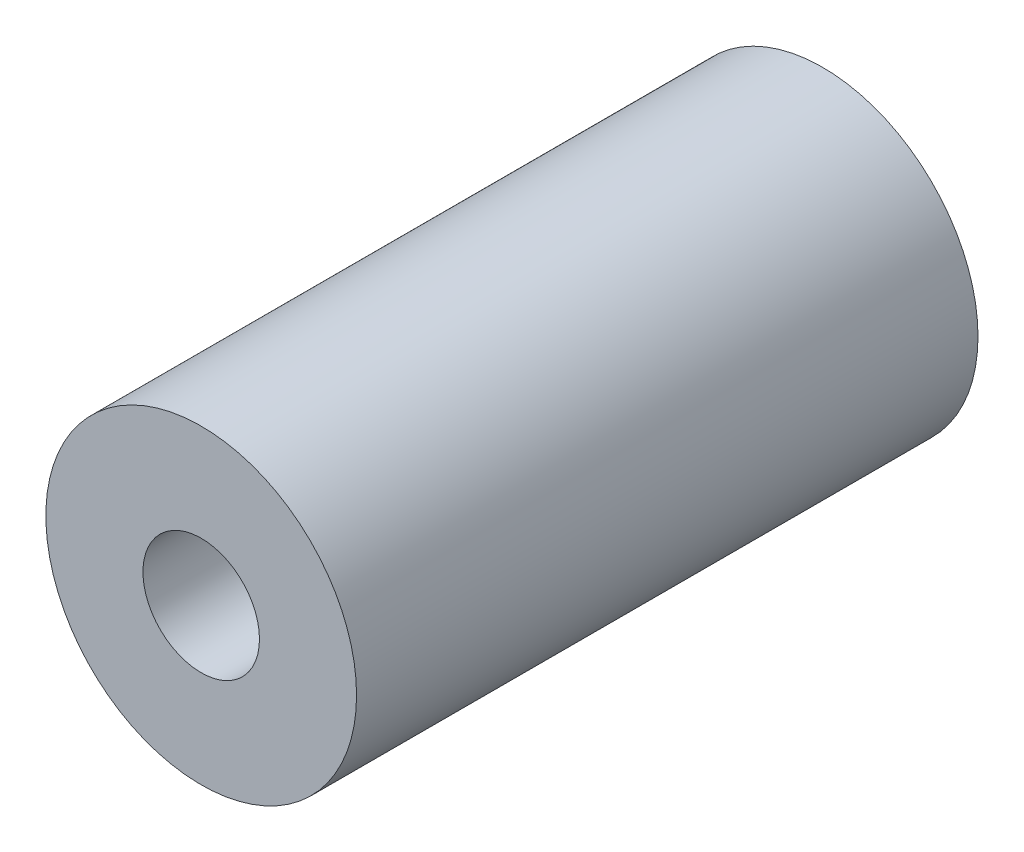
ISO-10303-21;
HEADER;
FILE_DESCRIPTION(('STEP AP214'),'2;1');
FILE_NAME('part.step','',(''),(''),'','','');
FILE_SCHEMA(('AUTOMOTIVE_DESIGN { 1 0 10303 214 1 1 1 1 }'));
ENDSEC;
DATA;
#1=APPLICATION_CONTEXT('core data for automotive mechanical design processes');
#2=APPLICATION_PROTOCOL_DEFINITION('international standard','automotive_design',2000,#1);
#3=PRODUCT_CONTEXT('',#1,'mechanical');
#4=PRODUCT('Part','Part','',(#3));
#5=PRODUCT_RELATED_PRODUCT_CATEGORY('part','',(#4));
#6=PRODUCT_DEFINITION_FORMATION('','',#4);
#7=PRODUCT_DEFINITION_CONTEXT('part definition',#1,'design');
#8=PRODUCT_DEFINITION('design','',#6,#7);
#9=PRODUCT_DEFINITION_SHAPE('','',#8);
#10=(LENGTH_UNIT() NAMED_UNIT(*) SI_UNIT(.MILLI.,.METRE.));
#11=(NAMED_UNIT(*) PLANE_ANGLE_UNIT() SI_UNIT($,.RADIAN.));
#12=(NAMED_UNIT(*) SI_UNIT($,.STERADIAN.) SOLID_ANGLE_UNIT());
#13=UNCERTAINTY_MEASURE_WITH_UNIT(LENGTH_MEASURE(1.E-05),#10,'distance_accuracy_value','');
#14=(GEOMETRIC_REPRESENTATION_CONTEXT(3) GLOBAL_UNCERTAINTY_ASSIGNED_CONTEXT((#13)) GLOBAL_UNIT_ASSIGNED_CONTEXT((#10,
#11,#12)) REPRESENTATION_CONTEXT('',''));
#15=CARTESIAN_POINT('',(0.,0.,0.));
#16=DIRECTION('',(0.,0.,1.));
#17=DIRECTION('',(1.,0.,0.));
#18=AXIS2_PLACEMENT_3D('',#15,#16,#17);
#19=CARTESIAN_POINT('',(0.,0.,50.8));
#20=DIRECTION('',(0.,0.,1.));
#21=DIRECTION('',(1.,0.,0.));
#22=AXIS2_PLACEMENT_3D('',#19,#20,#21);
#23=PLANE('',#22);
#24=CARTESIAN_POINT('',(0.,0.,50.8));
#25=DIRECTION('',(0.,0.,1.));
#26=DIRECTION('',(1.,0.,0.));
#27=AXIS2_PLACEMENT_3D('',#24,#25,#26);
#28=CIRCLE('',#27,12.7);
#29=CARTESIAN_POINT('',(12.7,0.,50.8));
#30=VERTEX_POINT('',#29);
#31=EDGE_CURVE('E10',#30,#30,#28,.T.);
#32=ORIENTED_EDGE('',*,*,#31,.T.);
#33=EDGE_LOOP('',(#32));
#34=FACE_BOUND('',#33,.T.);
#35=CARTESIAN_POINT('',(0.,0.,50.8));
#36=DIRECTION('',(0.,0.,1.));
#37=DIRECTION('',(1.,0.,0.));
#38=AXIS2_PLACEMENT_3D('',#35,#36,#37);
#39=CIRCLE('',#38,4.7625);
#40=CARTESIAN_POINT('',(4.7625,0.,50.8));
#41=VERTEX_POINT('',#40);
#42=EDGE_CURVE('E40',#41,#41,#39,.T.);
#43=ORIENTED_EDGE('',*,*,#42,.F.);
#44=EDGE_LOOP('',(#43));
#45=FACE_BOUND('',#44,.T.);
#46=ADVANCED_FACE('F29',(#34,#45),#23,.T.);
#47=CARTESIAN_POINT('',(0.,0.,0.));
#48=DIRECTION('',(0.,0.,1.));
#49=DIRECTION('',(1.,0.,0.));
#50=AXIS2_PLACEMENT_3D('',#47,#48,#49);
#51=PLANE('',#50);
#52=CARTESIAN_POINT('',(0.,0.,0.));
#53=DIRECTION('',(0.,0.,1.));
#54=DIRECTION('',(1.,0.,0.));
#55=AXIS2_PLACEMENT_3D('',#52,#53,#54);
#56=CIRCLE('',#55,12.7);
#57=CARTESIAN_POINT('',(12.7,0.,0.));
#58=VERTEX_POINT('',#57);
#59=EDGE_CURVE('E36',#58,#58,#56,.T.);
#60=ORIENTED_EDGE('',*,*,#59,.F.);
#61=EDGE_LOOP('',(#60));
#62=FACE_BOUND('',#61,.T.);
#63=CARTESIAN_POINT('',(0.,0.,0.));
#64=DIRECTION('',(0.,0.,1.));
#65=DIRECTION('',(1.,0.,0.));
#66=AXIS2_PLACEMENT_3D('',#63,#64,#65);
#67=CIRCLE('',#66,4.7625);
#68=CARTESIAN_POINT('',(4.7625,0.,0.));
#69=VERTEX_POINT('',#68);
#70=EDGE_CURVE('E44',#69,#69,#67,.T.);
#71=ORIENTED_EDGE('',*,*,#70,.T.);
#72=EDGE_LOOP('',(#71));
#73=FACE_BOUND('',#72,.T.);
#74=ADVANCED_FACE('F50',(#62,#73),#51,.F.);
#75=CARTESIAN_POINT('',(0.,0.,50.8));
#76=DIRECTION('',(0.,0.,-1.));
#77=DIRECTION('',(-1.,0.,0.));
#78=AXIS2_PLACEMENT_3D('',#75,#76,#77);
#79=CYLINDRICAL_SURFACE('',#78,12.7);
#80=ORIENTED_EDGE('',*,*,#31,.F.);
#81=EDGE_LOOP('',(#80));
#82=FACE_BOUND('',#81,.T.);
#83=ORIENTED_EDGE('',*,*,#59,.T.);
#84=EDGE_LOOP('',(#83));
#85=FACE_BOUND('',#84,.T.);
#86=ADVANCED_FACE('F31',(#82,#85),#79,.T.);
#87=CARTESIAN_POINT('',(0.,0.,50.8));
#88=DIRECTION('',(0.,0.,-1.));
#89=DIRECTION('',(-1.,0.,0.));
#90=AXIS2_PLACEMENT_3D('',#87,#88,#89);
#91=CYLINDRICAL_SURFACE('',#90,4.7625);
#92=ORIENTED_EDGE('',*,*,#42,.T.);
#93=EDGE_LOOP('',(#92));
#94=FACE_BOUND('',#93,.T.);
#95=ORIENTED_EDGE('',*,*,#70,.F.);
#96=EDGE_LOOP('',(#95));
#97=FACE_BOUND('',#96,.T.);
#98=ADVANCED_FACE('F52',(#94,#97),#91,.F.);
#99=CLOSED_SHELL('',(#46,#74,#86,#98));
#100=MANIFOLD_SOLID_BREP('B2',#99);
#101=ADVANCED_BREP_SHAPE_REPRESENTATION('',(#18,#100),#14);
#102=SHAPE_DEFINITION_REPRESENTATION(#9,#101);
ENDSEC;
END-ISO-10303-21;
